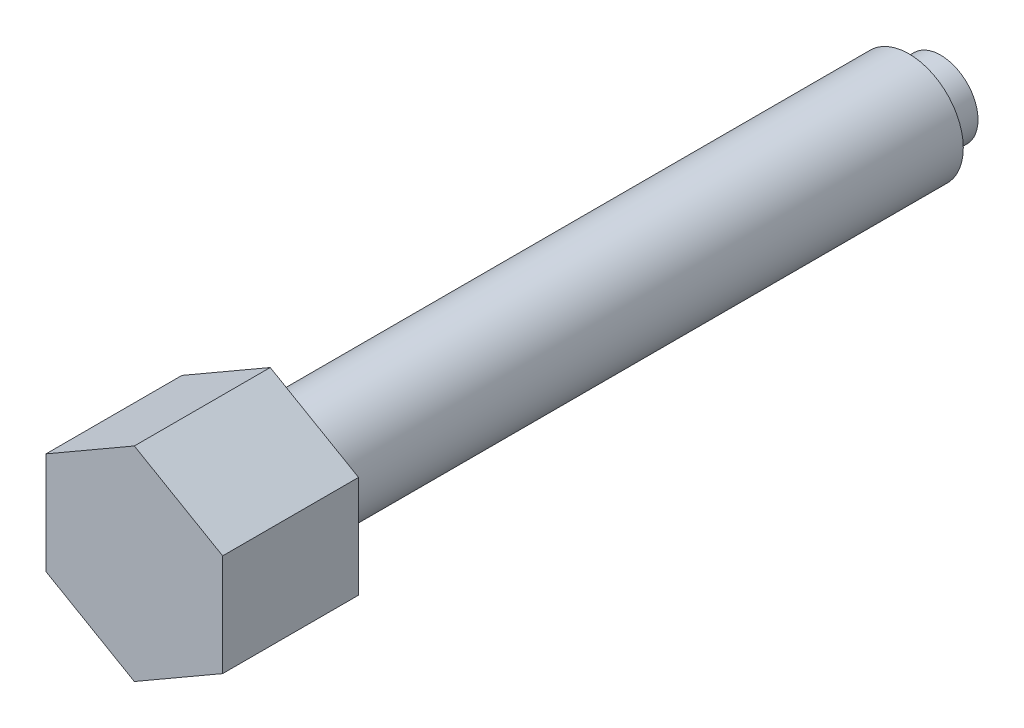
ISO-10303-21;
HEADER;
FILE_DESCRIPTION(('STEP AP214'),'2;1');
FILE_NAME('part.step','',(''),(''),'','','');
FILE_SCHEMA(('AUTOMOTIVE_DESIGN { 1 0 10303 214 1 1 1 1 }'));
ENDSEC;
DATA;
#1=APPLICATION_CONTEXT('core data for automotive mechanical design processes');
#2=APPLICATION_PROTOCOL_DEFINITION('international standard','automotive_design',2000,#1);
#3=PRODUCT_CONTEXT('',#1,'mechanical');
#4=PRODUCT('Part','Part','',(#3));
#5=PRODUCT_RELATED_PRODUCT_CATEGORY('part','',(#4));
#6=PRODUCT_DEFINITION_FORMATION('','',#4);
#7=PRODUCT_DEFINITION_CONTEXT('part definition',#1,'design');
#8=PRODUCT_DEFINITION('design','',#6,#7);
#9=PRODUCT_DEFINITION_SHAPE('','',#8);
#10=(LENGTH_UNIT() NAMED_UNIT(*) SI_UNIT(.MILLI.,.METRE.));
#11=(NAMED_UNIT(*) PLANE_ANGLE_UNIT() SI_UNIT($,.RADIAN.));
#12=(NAMED_UNIT(*) SI_UNIT($,.STERADIAN.) SOLID_ANGLE_UNIT());
#13=UNCERTAINTY_MEASURE_WITH_UNIT(LENGTH_MEASURE(1.E-05),#10,'distance_accuracy_value','');
#14=(GEOMETRIC_REPRESENTATION_CONTEXT(3) GLOBAL_UNCERTAINTY_ASSIGNED_CONTEXT((#13)) GLOBAL_UNIT_ASSIGNED_CONTEXT((#10,
#11,#12)) REPRESENTATION_CONTEXT('',''));
#15=CARTESIAN_POINT('',(0.,0.,0.));
#16=DIRECTION('',(0.,0.,1.));
#17=DIRECTION('',(1.,0.,0.));
#18=AXIS2_PLACEMENT_3D('',#15,#16,#17);
#19=CARTESIAN_POINT('',(0.,0.,6.));
#20=DIRECTION('',(0.,0.,1.));
#21=DIRECTION('',(1.,0.,0.));
#22=AXIS2_PLACEMENT_3D('',#19,#20,#21);
#23=SPHERICAL_SURFACE('',#22,6.);
#24=CARTESIAN_POINT('',(0.,0.,0.667317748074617));
#25=DIRECTION('',(0.,0.,1.));
#26=DIRECTION('',(1.,0.,0.));
#27=AXIS2_PLACEMENT_3D('',#24,#25,#26);
#28=CIRCLE('',#27,2.75);
#29=CARTESIAN_POINT('',(2.75,0.,0.667317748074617));
#30=VERTEX_POINT('',#29);
#31=EDGE_CURVE('E9',#30,#30,#28,.T.);
#32=ORIENTED_EDGE('',*,*,#31,.F.);
#33=EDGE_LOOP('',(#32));
#34=FACE_BOUND('',#33,.T.);
#35=ADVANCED_FACE('F14',(#34),#23,.T.);
#36=CARTESIAN_POINT('',(0.,0.,110.));
#37=DIRECTION('',(0.,0.,1.));
#38=DIRECTION('',(1.,0.,0.));
#39=AXIS2_PLACEMENT_3D('',#36,#37,#38);
#40=CYLINDRICAL_SURFACE('',#39,2.75);
#41=ORIENTED_EDGE('',*,*,#31,.T.);
#42=EDGE_LOOP('',(#41));
#43=FACE_BOUND('',#42,.T.);
#44=CARTESIAN_POINT('',(0.,0.,3.));
#45=DIRECTION('',(0.,0.,1.));
#46=DIRECTION('',(1.,0.,0.));
#47=AXIS2_PLACEMENT_3D('',#44,#45,#46);
#48=CIRCLE('',#47,2.75);
#49=CARTESIAN_POINT('',(2.75,0.,3.));
#50=VERTEX_POINT('',#49);
#51=EDGE_CURVE('E21',#50,#50,#48,.T.);
#52=ORIENTED_EDGE('',*,*,#51,.F.);
#53=EDGE_LOOP('',(#52));
#54=FACE_BOUND('',#53,.T.);
#55=ADVANCED_FACE('F129',(#43,#54),#40,.T.);
#56=CARTESIAN_POINT('',(2.75,0.,3.));
#57=DIRECTION('',(0.,0.,1.));
#58=DIRECTION('',(1.,0.,0.));
#59=AXIS2_PLACEMENT_3D('',#56,#57,#58);
#60=PLANE('',#59);
#61=CARTESIAN_POINT('',(0.,0.,3.));
#62=DIRECTION('',(0.,0.,1.));
#63=DIRECTION('',(1.,0.,0.));
#64=AXIS2_PLACEMENT_3D('',#61,#62,#63);
#65=CIRCLE('',#64,4.);
#66=CARTESIAN_POINT('',(4.,0.,3.));
#67=VERTEX_POINT('',#66);
#68=EDGE_CURVE('E122',#67,#67,#65,.T.);
#69=ORIENTED_EDGE('',*,*,#68,.F.);
#70=EDGE_LOOP('',(#69));
#71=FACE_BOUND('',#70,.T.);
#72=ORIENTED_EDGE('',*,*,#51,.T.);
#73=EDGE_LOOP('',(#72));
#74=FACE_BOUND('',#73,.T.);
#75=ADVANCED_FACE('F127',(#71,#74),#60,.F.);
#76=CARTESIAN_POINT('',(0.,0.,110.));
#77=DIRECTION('',(0.,0.,1.));
#78=DIRECTION('',(1.,0.,0.));
#79=AXIS2_PLACEMENT_3D('',#76,#77,#78);
#80=CYLINDRICAL_SURFACE('',#79,4.);
#81=CARTESIAN_POINT('',(0.,0.,50.));
#82=DIRECTION('',(0.,0.,1.));
#83=DIRECTION('',(1.,0.,0.));
#84=AXIS2_PLACEMENT_3D('',#81,#82,#83);
#85=CIRCLE('',#84,4.);
#86=CARTESIAN_POINT('',(4.,0.,50.));
#87=VERTEX_POINT('',#86);
#88=EDGE_CURVE('E119',#87,#87,#85,.T.);
#89=ORIENTED_EDGE('',*,*,#88,.F.);
#90=EDGE_LOOP('',(#89));
#91=FACE_BOUND('',#90,.T.);
#92=ORIENTED_EDGE('',*,*,#68,.T.);
#93=EDGE_LOOP('',(#92));
#94=FACE_BOUND('',#93,.T.);
#95=ADVANCED_FACE('F138',(#91,#94),#80,.T.);
#96=CARTESIAN_POINT('',(4.,0.,50.));
#97=DIRECTION('',(0.,0.,1.));
#98=DIRECTION('',(1.,0.,0.));
#99=AXIS2_PLACEMENT_3D('',#96,#97,#98);
#100=PLANE('',#99);
#101=DIRECTION('',(-0.866025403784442,-0.5,0.));
#102=VECTOR('',#101,1.);
#103=CARTESIAN_POINT('',(-0.24999999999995,7.36121593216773,50.));
#104=LINE('',#103,#102);
#105=CARTESIAN_POINT('',(0.,7.50555349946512,50.));
#106=VERTEX_POINT('',#105);
#107=CARTESIAN_POINT('',(-6.5,3.75277674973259,50.));
#108=VERTEX_POINT('',#107);
#109=EDGE_CURVE('E78',#106,#108,#104,.T.);
#110=ORIENTED_EDGE('',*,*,#109,.F.);
#111=DIRECTION('',(0.86602540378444,-0.5,0.));
#112=VECTOR('',#111,1.);
#113=CARTESIAN_POINT('',(6.25,3.89711431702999,50.));
#114=LINE('',#113,#112);
#115=CARTESIAN_POINT('',(6.5,3.75277674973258,50.));
#116=VERTEX_POINT('',#115);
#117=EDGE_CURVE('E117',#106,#116,#114,.T.);
#118=ORIENTED_EDGE('',*,*,#117,.T.);
#119=DIRECTION('',(0.,-1.,0.));
#120=VECTOR('',#119,1.);
#121=CARTESIAN_POINT('',(6.5,0.,50.));
#122=LINE('',#121,#120);
#123=CARTESIAN_POINT('',(6.5,-3.75277674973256,50.));
#124=VERTEX_POINT('',#123);
#125=EDGE_CURVE('E75',#116,#124,#122,.T.);
#126=ORIENTED_EDGE('',*,*,#125,.T.);
#127=DIRECTION('',(0.866025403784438,0.5,0.));
#128=VECTOR('',#127,1.);
#129=CARTESIAN_POINT('',(6.25,-3.89711431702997,50.));
#130=LINE('',#129,#128);
#131=CARTESIAN_POINT('',(0.,-7.50555349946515,50.));
#132=VERTEX_POINT('',#131);
#133=EDGE_CURVE('E114',#132,#124,#130,.T.);
#134=ORIENTED_EDGE('',*,*,#133,.F.);
#135=DIRECTION('',(-0.866025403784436,0.5,0.));
#136=VECTOR('',#135,1.);
#137=CARTESIAN_POINT('',(-0.250000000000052,-7.36121593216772,50.));
#138=LINE('',#137,#136);
#139=CARTESIAN_POINT('',(-6.5,-3.75277674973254,50.));
#140=VERTEX_POINT('',#139);
#141=EDGE_CURVE('E111',#132,#140,#138,.T.);
#142=ORIENTED_EDGE('',*,*,#141,.T.);
#143=DIRECTION('',(0.,-1.,0.));
#144=VECTOR('',#143,1.);
#145=CARTESIAN_POINT('',(-6.5,0.,50.));
#146=LINE('',#145,#144);
#147=EDGE_CURVE('E109',#108,#140,#146,.T.);
#148=ORIENTED_EDGE('',*,*,#147,.F.);
#149=EDGE_LOOP('',(#110,#118,#126,#134,#142,#148));
#150=FACE_BOUND('',#149,.T.);
#151=ORIENTED_EDGE('',*,*,#88,.T.);
#152=EDGE_LOOP('',(#151));
#153=FACE_BOUND('',#152,.T.);
#154=ADVANCED_FACE('F145',(#150,#153),#100,.F.);
#155=CARTESIAN_POINT('',(0.,7.50555349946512,48.));
#156=DIRECTION('',(-0.5,-0.86602540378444,0.));
#157=DIRECTION('',(0.86602540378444,-0.5,0.));
#158=AXIS2_PLACEMENT_3D('',#155,#156,#157);
#159=PLANE('',#158);
#160=DIRECTION('',(0.,0.,1.));
#161=VECTOR('',#160,1.);
#162=CARTESIAN_POINT('',(0.,7.50555349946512,48.));
#163=LINE('',#162,#161);
#164=CARTESIAN_POINT('',(0.,7.50555349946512,60.));
#165=VERTEX_POINT('',#164);
#166=EDGE_CURVE('E28',#106,#165,#163,.T.);
#167=ORIENTED_EDGE('',*,*,#166,.T.);
#168=DIRECTION('',(0.86602540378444,-0.5,0.));
#169=VECTOR('',#168,1.);
#170=CARTESIAN_POINT('',(0.,7.50555349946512,60.));
#171=LINE('',#170,#169);
#172=CARTESIAN_POINT('',(6.5,3.75277674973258,60.));
#173=VERTEX_POINT('',#172);
#174=EDGE_CURVE('E82',#165,#173,#171,.T.);
#175=ORIENTED_EDGE('',*,*,#174,.T.);
#176=DIRECTION('',(0.,0.,1.));
#177=VECTOR('',#176,1.);
#178=CARTESIAN_POINT('',(6.5,3.75277674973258,48.));
#179=LINE('',#178,#177);
#180=EDGE_CURVE('E67',#116,#173,#179,.T.);
#181=ORIENTED_EDGE('',*,*,#180,.F.);
#182=ORIENTED_EDGE('',*,*,#117,.F.);
#183=EDGE_LOOP('',(#167,#175,#181,#182));
#184=FACE_BOUND('',#183,.T.);
#185=ADVANCED_FACE('F83',(#184),#159,.F.);
#186=CARTESIAN_POINT('',(6.5,3.75277674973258,48.));
#187=DIRECTION('',(-1.,0.,0.));
#188=DIRECTION('',(0.,-1.,0.));
#189=AXIS2_PLACEMENT_3D('',#186,#187,#188);
#190=PLANE('',#189);
#191=ORIENTED_EDGE('',*,*,#180,.T.);
#192=DIRECTION('',(0.,-1.,0.));
#193=VECTOR('',#192,1.);
#194=CARTESIAN_POINT('',(6.5,3.75277674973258,60.));
#195=LINE('',#194,#193);
#196=CARTESIAN_POINT('',(6.5,-3.75277674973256,60.));
#197=VERTEX_POINT('',#196);
#198=EDGE_CURVE('E72',#173,#197,#195,.T.);
#199=ORIENTED_EDGE('',*,*,#198,.T.);
#200=DIRECTION('',(0.,0.,1.));
#201=VECTOR('',#200,1.);
#202=CARTESIAN_POINT('',(6.5,-3.75277674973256,48.));
#203=LINE('',#202,#201);
#204=EDGE_CURVE('E79',#124,#197,#203,.T.);
#205=ORIENTED_EDGE('',*,*,#204,.F.);
#206=ORIENTED_EDGE('',*,*,#125,.F.);
#207=EDGE_LOOP('',(#191,#199,#205,#206));
#208=FACE_BOUND('',#207,.T.);
#209=ADVANCED_FACE('F69',(#208),#190,.F.);
#210=CARTESIAN_POINT('',(0.,-7.50555349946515,48.));
#211=DIRECTION('',(0.5,-0.866025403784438,0.));
#212=DIRECTION('',(0.866025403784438,0.5,0.));
#213=AXIS2_PLACEMENT_3D('',#210,#211,#212);
#214=PLANE('',#213);
#215=ORIENTED_EDGE('',*,*,#133,.T.);
#216=ORIENTED_EDGE('',*,*,#204,.T.);
#217=DIRECTION('',(0.866025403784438,0.5,0.));
#218=VECTOR('',#217,1.);
#219=CARTESIAN_POINT('',(0.,-7.50555349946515,60.));
#220=LINE('',#219,#218);
#221=CARTESIAN_POINT('',(0.,-7.50555349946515,60.));
#222=VERTEX_POINT('',#221);
#223=EDGE_CURVE('E90',#222,#197,#220,.T.);
#224=ORIENTED_EDGE('',*,*,#223,.F.);
#225=DIRECTION('',(0.,0.,1.));
#226=VECTOR('',#225,1.);
#227=CARTESIAN_POINT('',(0.,-7.50555349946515,48.));
#228=LINE('',#227,#226);
#229=EDGE_CURVE('E105',#132,#222,#228,.T.);
#230=ORIENTED_EDGE('',*,*,#229,.F.);
#231=EDGE_LOOP('',(#215,#216,#224,#230));
#232=FACE_BOUND('',#231,.T.);
#233=ADVANCED_FACE('F155',(#232),#214,.T.);
#234=CARTESIAN_POINT('',(0.,-7.50555349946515,48.));
#235=DIRECTION('',(0.5,0.866025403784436,0.));
#236=DIRECTION('',(-0.866025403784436,0.5,0.));
#237=AXIS2_PLACEMENT_3D('',#234,#235,#236);
#238=PLANE('',#237);
#239=ORIENTED_EDGE('',*,*,#229,.T.);
#240=DIRECTION('',(-0.866025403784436,0.5,0.));
#241=VECTOR('',#240,1.);
#242=CARTESIAN_POINT('',(0.,-7.50555349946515,60.));
#243=LINE('',#242,#241);
#244=CARTESIAN_POINT('',(-6.5,-3.75277674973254,60.));
#245=VERTEX_POINT('',#244);
#246=EDGE_CURVE('E92',#222,#245,#243,.T.);
#247=ORIENTED_EDGE('',*,*,#246,.T.);
#248=DIRECTION('',(0.,0.,1.));
#249=VECTOR('',#248,1.);
#250=CARTESIAN_POINT('',(-6.5,-3.75277674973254,48.));
#251=LINE('',#250,#249);
#252=EDGE_CURVE('E103',#140,#245,#251,.T.);
#253=ORIENTED_EDGE('',*,*,#252,.F.);
#254=ORIENTED_EDGE('',*,*,#141,.F.);
#255=EDGE_LOOP('',(#239,#247,#253,#254));
#256=FACE_BOUND('',#255,.T.);
#257=ADVANCED_FACE('F158',(#256),#238,.F.);
#258=CARTESIAN_POINT('',(-6.5,3.75277674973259,48.));
#259=DIRECTION('',(-1.,0.,0.));
#260=DIRECTION('',(0.,-1.,0.));
#261=AXIS2_PLACEMENT_3D('',#258,#259,#260);
#262=PLANE('',#261);
#263=ORIENTED_EDGE('',*,*,#147,.T.);
#264=ORIENTED_EDGE('',*,*,#252,.T.);
#265=DIRECTION('',(0.,-1.,0.));
#266=VECTOR('',#265,1.);
#267=CARTESIAN_POINT('',(-6.5,3.75277674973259,60.));
#268=LINE('',#267,#266);
#269=CARTESIAN_POINT('',(-6.5,3.75277674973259,60.));
#270=VERTEX_POINT('',#269);
#271=EDGE_CURVE('E36',#270,#245,#268,.T.);
#272=ORIENTED_EDGE('',*,*,#271,.F.);
#273=DIRECTION('',(0.,0.,1.));
#274=VECTOR('',#273,1.);
#275=CARTESIAN_POINT('',(-6.5,3.75277674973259,48.));
#276=LINE('',#275,#274);
#277=EDGE_CURVE('E101',#108,#270,#276,.T.);
#278=ORIENTED_EDGE('',*,*,#277,.F.);
#279=EDGE_LOOP('',(#263,#264,#272,#278));
#280=FACE_BOUND('',#279,.T.);
#281=ADVANCED_FACE('F162',(#280),#262,.T.);
#282=CARTESIAN_POINT('',(0.,7.50555349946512,48.));
#283=DIRECTION('',(-0.5,0.866025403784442,0.));
#284=DIRECTION('',(-0.866025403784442,-0.5,0.));
#285=AXIS2_PLACEMENT_3D('',#282,#283,#284);
#286=PLANE('',#285);
#287=ORIENTED_EDGE('',*,*,#109,.T.);
#288=ORIENTED_EDGE('',*,*,#277,.T.);
#289=DIRECTION('',(-0.866025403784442,-0.5,0.));
#290=VECTOR('',#289,1.);
#291=CARTESIAN_POINT('',(0.,7.50555349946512,60.));
#292=LINE('',#291,#290);
#293=EDGE_CURVE('E95',#165,#270,#292,.T.);
#294=ORIENTED_EDGE('',*,*,#293,.F.);
#295=ORIENTED_EDGE('',*,*,#166,.F.);
#296=EDGE_LOOP('',(#287,#288,#294,#295));
#297=FACE_BOUND('',#296,.T.);
#298=ADVANCED_FACE('F152',(#297),#286,.T.);
#299=CARTESIAN_POINT('',(0.,0.,60.));
#300=DIRECTION('',(0.,0.,1.));
#301=DIRECTION('',(1.,0.,0.));
#302=AXIS2_PLACEMENT_3D('',#299,#300,#301);
#303=PLANE('',#302);
#304=ORIENTED_EDGE('',*,*,#174,.F.);
#305=ORIENTED_EDGE('',*,*,#293,.T.);
#306=ORIENTED_EDGE('',*,*,#271,.T.);
#307=ORIENTED_EDGE('',*,*,#246,.F.);
#308=ORIENTED_EDGE('',*,*,#223,.T.);
#309=ORIENTED_EDGE('',*,*,#198,.F.);
#310=EDGE_LOOP('',(#304,#305,#306,#307,#308,#309));
#311=FACE_BOUND('',#310,.T.);
#312=ADVANCED_FACE('F87',(#311),#303,.T.);
#313=CLOSED_SHELL('',(#35,#55,#75,#95,#154,#185,#209,#233,#257,#281,#298,#312));
#314=MANIFOLD_SOLID_BREP('B1',#313);
#315=ADVANCED_BREP_SHAPE_REPRESENTATION('',(#18,#314),#14);
#316=SHAPE_DEFINITION_REPRESENTATION(#9,#315);
ENDSEC;
END-ISO-10303-21;
